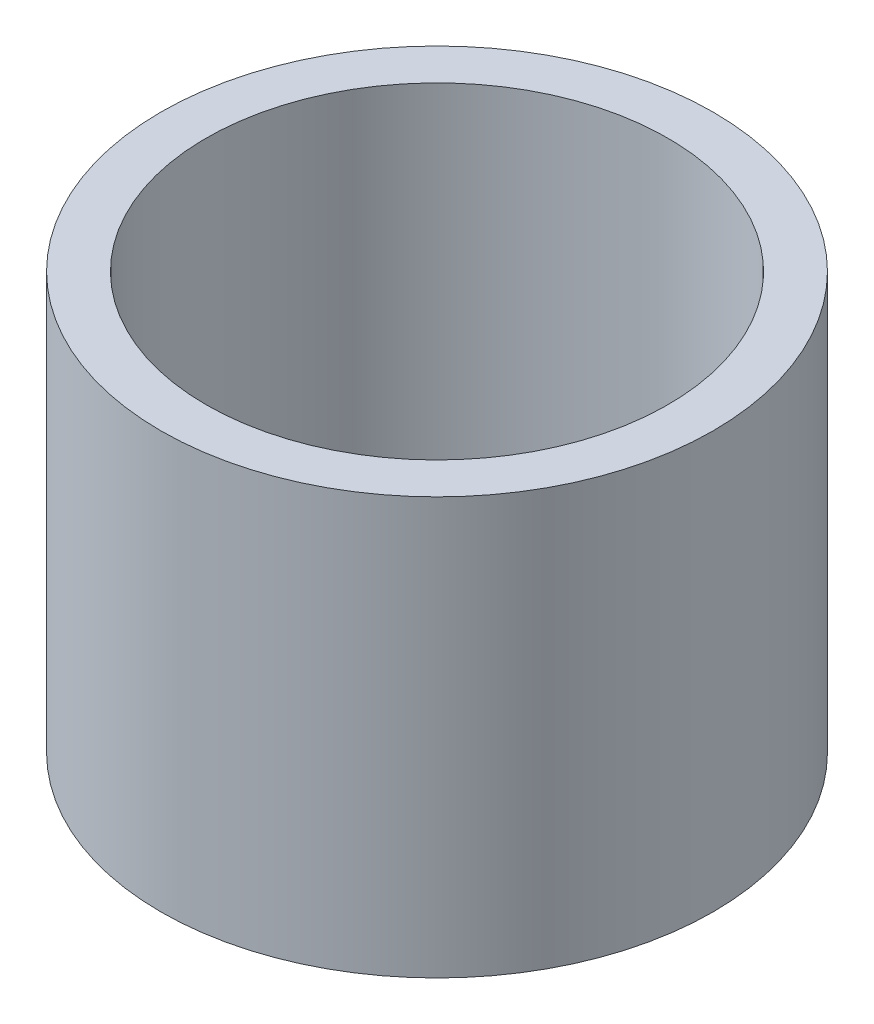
from build123d import *

# Parameters (mm, degrees)
SKETCH1_R      = 55
SKETCH1_R_2    = 46
EXTRUDE1_DEPTH = 83


with BuildPart() as part:
    # Sketch1 → Extrude1 (new body)
    with BuildSketch(Plane(origin=(0, 0, 0), x_dir=(1, 0, 0), z_dir=(0, 1, 0))):
        with Locations(Location((0, 0, 0), (0, 0, 270))):
            Circle(SKETCH1_R)
        with Locations(Location((0, 0, 0), (0, 0, 270))):
            Circle(SKETCH1_R_2, mode=Mode.SUBTRACT)
    extrude(amount=EXTRUDE1_DEPTH)


solid = part.part
